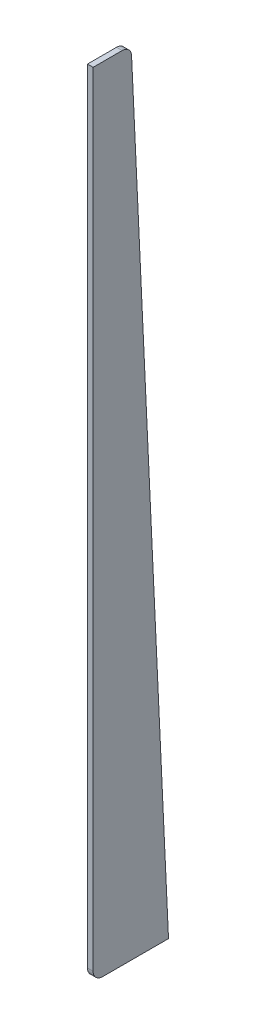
from build123d import *

# Parameters (mm, degrees)
EXTRUSION1_DEPTH = 3


with BuildPart() as part:
    # Esquisse1 → Extrusion1 (new body)
    with BuildSketch(Plane(origin=(0, 0, 0), x_dir=(0, 0, -1), z_dir=(1, 0, 0))):
        with BuildLine():
            Line((0, 0), (15.39996061, 0))
            ThreePointArc((15.39996061, 0), (18.851216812, -1.382151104), (20.394409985, -4.764467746))
            Line((20.394409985, -4.764467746), (40, -420.5))
            Line((40, -420.5), (5, -420.5))
            ThreePointArc((5, -420.5), (1.464466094, -419.035533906), (0, -415.5))
            Line((0, -415.5), (0, 0))
        make_face()
    extrude(amount=EXTRUSION1_DEPTH)


solid = part.part
